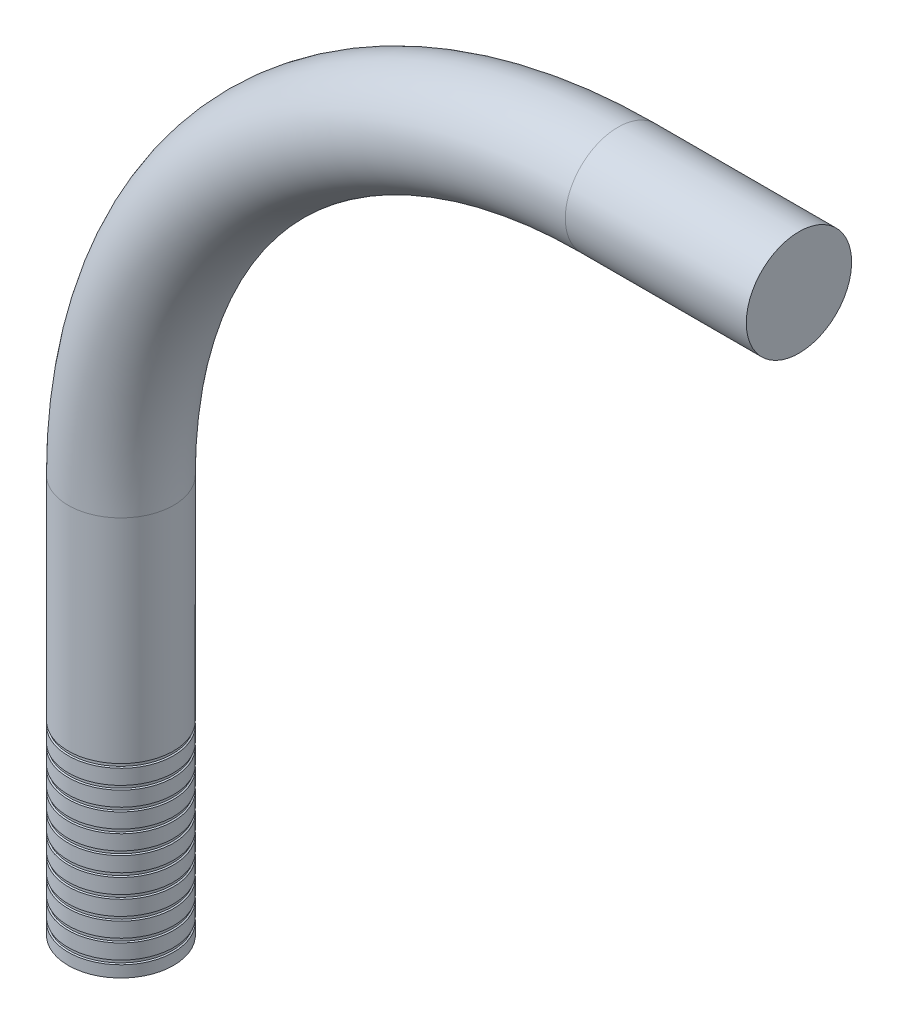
ISO-10303-21;
HEADER;
FILE_DESCRIPTION(('STEP AP214'),'2;1');
FILE_NAME('part.step','',(''),(''),'','','');
FILE_SCHEMA(('AUTOMOTIVE_DESIGN { 1 0 10303 214 1 1 1 1 }'));
ENDSEC;
DATA;
#1=APPLICATION_CONTEXT('core data for automotive mechanical design processes');
#2=APPLICATION_PROTOCOL_DEFINITION('international standard','automotive_design',2000,#1);
#3=PRODUCT_CONTEXT('',#1,'mechanical');
#4=PRODUCT('Part','Part','',(#3));
#5=PRODUCT_RELATED_PRODUCT_CATEGORY('part','',(#4));
#6=PRODUCT_DEFINITION_FORMATION('','',#4);
#7=PRODUCT_DEFINITION_CONTEXT('part definition',#1,'design');
#8=PRODUCT_DEFINITION('design','',#6,#7);
#9=PRODUCT_DEFINITION_SHAPE('','',#8);
#10=(LENGTH_UNIT() NAMED_UNIT(*) SI_UNIT(.MILLI.,.METRE.));
#11=(NAMED_UNIT(*) PLANE_ANGLE_UNIT() SI_UNIT($,.RADIAN.));
#12=(NAMED_UNIT(*) SI_UNIT($,.STERADIAN.) SOLID_ANGLE_UNIT());
#13=UNCERTAINTY_MEASURE_WITH_UNIT(LENGTH_MEASURE(1.E-05),#10,'distance_accuracy_value','');
#14=(GEOMETRIC_REPRESENTATION_CONTEXT(3) GLOBAL_UNCERTAINTY_ASSIGNED_CONTEXT((#13)) GLOBAL_UNIT_ASSIGNED_CONTEXT((#10,
#11,#12)) REPRESENTATION_CONTEXT('',''));
#15=CARTESIAN_POINT('',(0.,0.,0.));
#16=DIRECTION('',(0.,0.,1.));
#17=DIRECTION('',(1.,0.,0.));
#18=AXIS2_PLACEMENT_3D('',#15,#16,#17);
#19=CARTESIAN_POINT('',(0.,147.5,0.));
#20=DIRECTION('',(0.,-1.,0.));
#21=DIRECTION('',(0.,0.,-1.));
#22=AXIS2_PLACEMENT_3D('',#19,#20,#21);
#23=CYLINDRICAL_SURFACE('',#22,19.5);
#24=CARTESIAN_POINT('',(0.,67.25,0.));
#25=DIRECTION('',(0.,-1.,0.));
#26=DIRECTION('',(0.,0.,-1.));
#27=AXIS2_PLACEMENT_3D('',#24,#25,#26);
#28=CIRCLE('',#27,19.5);
#29=CARTESIAN_POINT('',(0.,67.25,-19.5));
#30=VERTEX_POINT('',#29);
#31=EDGE_CURVE('E145',#30,#30,#28,.T.);
#32=ORIENTED_EDGE('',*,*,#31,.T.);
#33=EDGE_LOOP('',(#32));
#34=FACE_BOUND('',#33,.T.);
#35=CARTESIAN_POINT('',(0.,61.75,0.));
#36=DIRECTION('',(0.,-1.,0.));
#37=DIRECTION('',(0.,0.,-1.));
#38=AXIS2_PLACEMENT_3D('',#35,#36,#37);
#39=CIRCLE('',#38,19.5);
#40=CARTESIAN_POINT('',(0.,61.75,-19.5));
#41=VERTEX_POINT('',#40);
#42=EDGE_CURVE('E136',#41,#41,#39,.T.);
#43=ORIENTED_EDGE('',*,*,#42,.F.);
#44=EDGE_LOOP('',(#43));
#45=FACE_BOUND('',#44,.T.);
#46=ADVANCED_FACE('F14',(#34,#45),#23,.T.);
#47=CARTESIAN_POINT('',(0.,60.25,0.));
#48=DIRECTION('',(0.,-1.,0.));
#49=DIRECTION('',(0.,0.,-1.));
#50=AXIS2_PLACEMENT_3D('',#47,#48,#49);
#51=CIRCLE('',#50,19.5);
#52=CARTESIAN_POINT('',(0.,60.25,-19.5));
#53=VERTEX_POINT('',#52);
#54=EDGE_CURVE('E133',#53,#53,#51,.T.);
#55=ORIENTED_EDGE('',*,*,#54,.T.);
#56=EDGE_LOOP('',(#55));
#57=FACE_BOUND('',#56,.T.);
#58=CARTESIAN_POINT('',(0.,54.75,0.));
#59=DIRECTION('',(0.,-1.,0.));
#60=DIRECTION('',(0.,0.,-1.));
#61=AXIS2_PLACEMENT_3D('',#58,#59,#60);
#62=CIRCLE('',#61,19.5);
#63=CARTESIAN_POINT('',(0.,54.75,-19.5));
#64=VERTEX_POINT('',#63);
#65=EDGE_CURVE('E124',#64,#64,#62,.T.);
#66=ORIENTED_EDGE('',*,*,#65,.F.);
#67=EDGE_LOOP('',(#66));
#68=FACE_BOUND('',#67,.T.);
#69=ADVANCED_FACE('F181',(#57,#68),#23,.T.);
#70=CARTESIAN_POINT('',(0.,53.25,0.));
#71=DIRECTION('',(0.,-1.,0.));
#72=DIRECTION('',(0.,0.,-1.));
#73=AXIS2_PLACEMENT_3D('',#70,#71,#72);
#74=CIRCLE('',#73,19.5);
#75=CARTESIAN_POINT('',(0.,53.25,-19.5));
#76=VERTEX_POINT('',#75);
#77=EDGE_CURVE('E121',#76,#76,#74,.T.);
#78=ORIENTED_EDGE('',*,*,#77,.T.);
#79=EDGE_LOOP('',(#78));
#80=FACE_BOUND('',#79,.T.);
#81=CARTESIAN_POINT('',(0.,47.75,0.));
#82=DIRECTION('',(0.,-1.,0.));
#83=DIRECTION('',(0.,0.,-1.));
#84=AXIS2_PLACEMENT_3D('',#81,#82,#83);
#85=CIRCLE('',#84,19.5);
#86=CARTESIAN_POINT('',(0.,47.75,-19.5));
#87=VERTEX_POINT('',#86);
#88=EDGE_CURVE('E112',#87,#87,#85,.T.);
#89=ORIENTED_EDGE('',*,*,#88,.F.);
#90=EDGE_LOOP('',(#89));
#91=FACE_BOUND('',#90,.T.);
#92=ADVANCED_FACE('F187',(#80,#91),#23,.T.);
#93=CARTESIAN_POINT('',(0.,46.25,0.));
#94=DIRECTION('',(0.,-1.,0.));
#95=DIRECTION('',(0.,0.,-1.));
#96=AXIS2_PLACEMENT_3D('',#93,#94,#95);
#97=CIRCLE('',#96,19.5);
#98=CARTESIAN_POINT('',(0.,46.25,-19.5));
#99=VERTEX_POINT('',#98);
#100=EDGE_CURVE('E109',#99,#99,#97,.T.);
#101=ORIENTED_EDGE('',*,*,#100,.T.);
#102=EDGE_LOOP('',(#101));
#103=FACE_BOUND('',#102,.T.);
#104=CARTESIAN_POINT('',(0.,40.75,0.));
#105=DIRECTION('',(0.,-1.,0.));
#106=DIRECTION('',(0.,0.,-1.));
#107=AXIS2_PLACEMENT_3D('',#104,#105,#106);
#108=CIRCLE('',#107,19.5);
#109=CARTESIAN_POINT('',(0.,40.75,-19.5));
#110=VERTEX_POINT('',#109);
#111=EDGE_CURVE('E100',#110,#110,#108,.T.);
#112=ORIENTED_EDGE('',*,*,#111,.F.);
#113=EDGE_LOOP('',(#112));
#114=FACE_BOUND('',#113,.T.);
#115=ADVANCED_FACE('F578',(#103,#114),#23,.T.);
#116=CARTESIAN_POINT('',(0.,39.25,0.));
#117=DIRECTION('',(0.,-1.,0.));
#118=DIRECTION('',(0.,0.,-1.));
#119=AXIS2_PLACEMENT_3D('',#116,#117,#118);
#120=CIRCLE('',#119,19.5);
#121=CARTESIAN_POINT('',(0.,39.25,-19.5));
#122=VERTEX_POINT('',#121);
#123=EDGE_CURVE('E97',#122,#122,#120,.T.);
#124=ORIENTED_EDGE('',*,*,#123,.T.);
#125=EDGE_LOOP('',(#124));
#126=FACE_BOUND('',#125,.T.);
#127=CARTESIAN_POINT('',(0.,33.75,0.));
#128=DIRECTION('',(0.,-1.,0.));
#129=DIRECTION('',(0.,0.,-1.));
#130=AXIS2_PLACEMENT_3D('',#127,#128,#129);
#131=CIRCLE('',#130,19.5);
#132=CARTESIAN_POINT('',(0.,33.75,-19.5));
#133=VERTEX_POINT('',#132);
#134=EDGE_CURVE('E88',#133,#133,#131,.T.);
#135=ORIENTED_EDGE('',*,*,#134,.F.);
#136=EDGE_LOOP('',(#135));
#137=FACE_BOUND('',#136,.T.);
#138=ADVANCED_FACE('F570',(#126,#137),#23,.T.);
#139=CARTESIAN_POINT('',(0.,32.25,0.));
#140=DIRECTION('',(0.,-1.,0.));
#141=DIRECTION('',(0.,0.,-1.));
#142=AXIS2_PLACEMENT_3D('',#139,#140,#141);
#143=CIRCLE('',#142,19.5);
#144=CARTESIAN_POINT('',(0.,32.25,-19.5));
#145=VERTEX_POINT('',#144);
#146=EDGE_CURVE('E85',#145,#145,#143,.T.);
#147=ORIENTED_EDGE('',*,*,#146,.T.);
#148=EDGE_LOOP('',(#147));
#149=FACE_BOUND('',#148,.T.);
#150=CARTESIAN_POINT('',(0.,26.75,0.));
#151=DIRECTION('',(0.,-1.,0.));
#152=DIRECTION('',(0.,0.,-1.));
#153=AXIS2_PLACEMENT_3D('',#150,#151,#152);
#154=CIRCLE('',#153,19.5);
#155=CARTESIAN_POINT('',(0.,26.75,-19.5));
#156=VERTEX_POINT('',#155);
#157=EDGE_CURVE('E76',#156,#156,#154,.T.);
#158=ORIENTED_EDGE('',*,*,#157,.F.);
#159=EDGE_LOOP('',(#158));
#160=FACE_BOUND('',#159,.T.);
#161=ADVANCED_FACE('F562',(#149,#160),#23,.T.);
#162=CARTESIAN_POINT('',(0.,25.25,0.));
#163=DIRECTION('',(0.,-1.,0.));
#164=DIRECTION('',(0.,0.,-1.));
#165=AXIS2_PLACEMENT_3D('',#162,#163,#164);
#166=CIRCLE('',#165,19.5);
#167=CARTESIAN_POINT('',(0.,25.25,-19.5));
#168=VERTEX_POINT('',#167);
#169=EDGE_CURVE('E73',#168,#168,#166,.T.);
#170=ORIENTED_EDGE('',*,*,#169,.T.);
#171=EDGE_LOOP('',(#170));
#172=FACE_BOUND('',#171,.T.);
#173=CARTESIAN_POINT('',(0.,19.75,0.));
#174=DIRECTION('',(0.,-1.,0.));
#175=DIRECTION('',(0.,0.,-1.));
#176=AXIS2_PLACEMENT_3D('',#173,#174,#175);
#177=CIRCLE('',#176,19.5);
#178=CARTESIAN_POINT('',(0.,19.75,-19.5));
#179=VERTEX_POINT('',#178);
#180=EDGE_CURVE('E64',#179,#179,#177,.T.);
#181=ORIENTED_EDGE('',*,*,#180,.F.);
#182=EDGE_LOOP('',(#181));
#183=FACE_BOUND('',#182,.T.);
#184=ADVANCED_FACE('F554',(#172,#183),#23,.T.);
#185=CARTESIAN_POINT('',(0.,18.25,0.));
#186=DIRECTION('',(0.,-1.,0.));
#187=DIRECTION('',(0.,0.,-1.));
#188=AXIS2_PLACEMENT_3D('',#185,#186,#187);
#189=CIRCLE('',#188,19.5);
#190=CARTESIAN_POINT('',(0.,18.25,-19.5));
#191=VERTEX_POINT('',#190);
#192=EDGE_CURVE('E61',#191,#191,#189,.T.);
#193=ORIENTED_EDGE('',*,*,#192,.T.);
#194=EDGE_LOOP('',(#193));
#195=FACE_BOUND('',#194,.T.);
#196=CARTESIAN_POINT('',(0.,12.75,0.));
#197=DIRECTION('',(0.,-1.,0.));
#198=DIRECTION('',(0.,0.,-1.));
#199=AXIS2_PLACEMENT_3D('',#196,#197,#198);
#200=CIRCLE('',#199,19.5);
#201=CARTESIAN_POINT('',(0.,12.75,-19.5));
#202=VERTEX_POINT('',#201);
#203=EDGE_CURVE('E52',#202,#202,#200,.T.);
#204=ORIENTED_EDGE('',*,*,#203,.F.);
#205=EDGE_LOOP('',(#204));
#206=FACE_BOUND('',#205,.T.);
#207=ADVANCED_FACE('F547',(#195,#206),#23,.T.);
#208=CARTESIAN_POINT('',(0.,11.25,0.));
#209=DIRECTION('',(0.,-1.,0.));
#210=DIRECTION('',(0.,0.,-1.));
#211=AXIS2_PLACEMENT_3D('',#208,#209,#210);
#212=CIRCLE('',#211,19.5);
#213=CARTESIAN_POINT('',(0.,11.25,-19.5));
#214=VERTEX_POINT('',#213);
#215=EDGE_CURVE('E49',#214,#214,#212,.T.);
#216=ORIENTED_EDGE('',*,*,#215,.T.);
#217=EDGE_LOOP('',(#216));
#218=FACE_BOUND('',#217,.T.);
#219=CARTESIAN_POINT('',(0.,5.75,0.));
#220=DIRECTION('',(0.,-1.,0.));
#221=DIRECTION('',(0.,0.,-1.));
#222=AXIS2_PLACEMENT_3D('',#219,#220,#221);
#223=CIRCLE('',#222,19.5);
#224=CARTESIAN_POINT('',(0.,5.75,-19.5));
#225=VERTEX_POINT('',#224);
#226=EDGE_CURVE('E40',#225,#225,#223,.T.);
#227=ORIENTED_EDGE('',*,*,#226,.F.);
#228=EDGE_LOOP('',(#227));
#229=FACE_BOUND('',#228,.T.);
#230=ADVANCED_FACE('F202',(#218,#229),#23,.T.);
#231=CARTESIAN_POINT('',(0.,0.,0.));
#232=DIRECTION('',(0.,-1.,0.));
#233=DIRECTION('',(0.,0.,-1.));
#234=AXIS2_PLACEMENT_3D('',#231,#232,#233);
#235=CYLINDRICAL_SURFACE('',#234,19.);
#236=CARTESIAN_POINT('',(0.,4.5,0.));
#237=DIRECTION('',(0.,-1.,0.));
#238=DIRECTION('',(0.,0.,-1.));
#239=AXIS2_PLACEMENT_3D('',#236,#237,#238);
#240=CIRCLE('',#239,19.);
#241=CARTESIAN_POINT('',(0.,4.5,-19.));
#242=VERTEX_POINT('',#241);
#243=EDGE_CURVE('E33',#242,#242,#240,.T.);
#244=ORIENTED_EDGE('',*,*,#243,.F.);
#245=EDGE_LOOP('',(#244));
#246=FACE_BOUND('',#245,.T.);
#247=CARTESIAN_POINT('',(0.,5.5,0.));
#248=DIRECTION('',(0.,-1.,0.));
#249=DIRECTION('',(0.,0.,-1.));
#250=AXIS2_PLACEMENT_3D('',#247,#248,#249);
#251=CIRCLE('',#250,19.);
#252=CARTESIAN_POINT('',(0.,5.5,-19.));
#253=VERTEX_POINT('',#252);
#254=EDGE_CURVE('E43',#253,#253,#251,.T.);
#255=ORIENTED_EDGE('',*,*,#254,.T.);
#256=EDGE_LOOP('',(#255));
#257=FACE_BOUND('',#256,.T.);
#258=ADVANCED_FACE('F198',(#246,#257),#235,.T.);
#259=CARTESIAN_POINT('',(0.,4.5,0.));
#260=DIRECTION('',(0.,-1.,0.));
#261=DIRECTION('',(0.,0.,-1.));
#262=AXIS2_PLACEMENT_3D('',#259,#260,#261);
#263=CONICAL_SURFACE('',#262,19.,1.10714871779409);
#264=CARTESIAN_POINT('',(0.,4.25,0.));
#265=DIRECTION('',(0.,-1.,0.));
#266=DIRECTION('',(0.,0.,-1.));
#267=AXIS2_PLACEMENT_3D('',#264,#265,#266);
#268=CIRCLE('',#267,19.5);
#269=CARTESIAN_POINT('',(0.,4.25,-19.5));
#270=VERTEX_POINT('',#269);
#271=EDGE_CURVE('E37',#270,#270,#268,.T.);
#272=ORIENTED_EDGE('',*,*,#271,.F.);
#273=EDGE_LOOP('',(#272));
#274=FACE_BOUND('',#273,.T.);
#275=ORIENTED_EDGE('',*,*,#243,.T.);
#276=EDGE_LOOP('',(#275));
#277=FACE_BOUND('',#276,.T.);
#278=ADVANCED_FACE('F201',(#274,#277),#263,.T.);
#279=CARTESIAN_POINT('',(0.,5.75,0.));
#280=DIRECTION('',(0.,1.,0.));
#281=DIRECTION('',(0.,0.,1.));
#282=AXIS2_PLACEMENT_3D('',#279,#280,#281);
#283=CONICAL_SURFACE('',#282,19.5,1.10714871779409);
#284=ORIENTED_EDGE('',*,*,#254,.F.);
#285=EDGE_LOOP('',(#284));
#286=FACE_BOUND('',#285,.T.);
#287=ORIENTED_EDGE('',*,*,#226,.T.);
#288=EDGE_LOOP('',(#287));
#289=FACE_BOUND('',#288,.T.);
#290=ADVANCED_FACE('F194',(#286,#289),#283,.T.);
#291=CARTESIAN_POINT('',(0.,0.,0.));
#292=DIRECTION('',(0.,1.,0.));
#293=DIRECTION('',(0.,0.,1.));
#294=AXIS2_PLACEMENT_3D('',#291,#292,#293);
#295=PLANE('',#294);
#296=CARTESIAN_POINT('',(0.,0.,0.));
#297=DIRECTION('',(0.,1.,0.));
#298=DIRECTION('',(0.,0.,1.));
#299=AXIS2_PLACEMENT_3D('',#296,#297,#298);
#300=CIRCLE('',#299,19.5);
#301=CARTESIAN_POINT('',(0.,0.,19.5));
#302=VERTEX_POINT('',#301);
#303=EDGE_CURVE('E29',#302,#302,#300,.T.);
#304=ORIENTED_EDGE('',*,*,#303,.F.);
#305=EDGE_LOOP('',(#304));
#306=FACE_BOUND('',#305,.T.);
#307=ADVANCED_FACE('F191',(#306),#295,.F.);
#308=ORIENTED_EDGE('',*,*,#271,.T.);
#309=EDGE_LOOP('',(#308));
#310=FACE_BOUND('',#309,.T.);
#311=ORIENTED_EDGE('',*,*,#303,.T.);
#312=EDGE_LOOP('',(#311));
#313=FACE_BOUND('',#312,.T.);
#314=ADVANCED_FACE('F170',(#310,#313),#23,.T.);
#315=CARTESIAN_POINT('',(0.,7.,0.));
#316=DIRECTION('',(0.,-1.,0.));
#317=DIRECTION('',(0.,0.,-1.));
#318=AXIS2_PLACEMENT_3D('',#315,#316,#317);
#319=CYLINDRICAL_SURFACE('',#318,19.);
#320=CARTESIAN_POINT('',(0.,11.5,0.));
#321=DIRECTION('',(0.,-1.,0.));
#322=DIRECTION('',(0.,0.,-1.));
#323=AXIS2_PLACEMENT_3D('',#320,#321,#322);
#324=CIRCLE('',#323,19.);
#325=CARTESIAN_POINT('',(0.,11.5,-19.));
#326=VERTEX_POINT('',#325);
#327=EDGE_CURVE('E46',#326,#326,#324,.T.);
#328=ORIENTED_EDGE('',*,*,#327,.F.);
#329=EDGE_LOOP('',(#328));
#330=FACE_BOUND('',#329,.T.);
#331=CARTESIAN_POINT('',(0.,12.5,0.));
#332=DIRECTION('',(0.,-1.,0.));
#333=DIRECTION('',(0.,0.,-1.));
#334=AXIS2_PLACEMENT_3D('',#331,#332,#333);
#335=CIRCLE('',#334,19.);
#336=CARTESIAN_POINT('',(0.,12.5,-19.));
#337=VERTEX_POINT('',#336);
#338=EDGE_CURVE('E55',#337,#337,#335,.T.);
#339=ORIENTED_EDGE('',*,*,#338,.T.);
#340=EDGE_LOOP('',(#339));
#341=FACE_BOUND('',#340,.T.);
#342=ADVANCED_FACE('F210',(#330,#341),#319,.T.);
#343=CARTESIAN_POINT('',(0.,11.5,0.));
#344=DIRECTION('',(0.,-1.,0.));
#345=DIRECTION('',(0.,0.,-1.));
#346=AXIS2_PLACEMENT_3D('',#343,#344,#345);
#347=CONICAL_SURFACE('',#346,19.,1.10714871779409);
#348=ORIENTED_EDGE('',*,*,#215,.F.);
#349=EDGE_LOOP('',(#348));
#350=FACE_BOUND('',#349,.T.);
#351=ORIENTED_EDGE('',*,*,#327,.T.);
#352=EDGE_LOOP('',(#351));
#353=FACE_BOUND('',#352,.T.);
#354=ADVANCED_FACE('F213',(#350,#353),#347,.T.);
#355=CARTESIAN_POINT('',(0.,12.75,0.));
#356=DIRECTION('',(0.,1.,0.));
#357=DIRECTION('',(0.,0.,1.));
#358=AXIS2_PLACEMENT_3D('',#355,#356,#357);
#359=CONICAL_SURFACE('',#358,19.5,1.10714871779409);
#360=ORIENTED_EDGE('',*,*,#338,.F.);
#361=EDGE_LOOP('',(#360));
#362=FACE_BOUND('',#361,.T.);
#363=ORIENTED_EDGE('',*,*,#203,.T.);
#364=EDGE_LOOP('',(#363));
#365=FACE_BOUND('',#364,.T.);
#366=ADVANCED_FACE('F217',(#362,#365),#359,.T.);
#367=CARTESIAN_POINT('',(0.,14.,0.));
#368=DIRECTION('',(0.,-1.,0.));
#369=DIRECTION('',(0.,0.,-1.));
#370=AXIS2_PLACEMENT_3D('',#367,#368,#369);
#371=CYLINDRICAL_SURFACE('',#370,19.);
#372=CARTESIAN_POINT('',(0.,18.5,0.));
#373=DIRECTION('',(0.,-1.,0.));
#374=DIRECTION('',(0.,0.,-1.));
#375=AXIS2_PLACEMENT_3D('',#372,#373,#374);
#376=CIRCLE('',#375,19.);
#377=CARTESIAN_POINT('',(0.,18.5,-19.));
#378=VERTEX_POINT('',#377);
#379=EDGE_CURVE('E58',#378,#378,#376,.T.);
#380=ORIENTED_EDGE('',*,*,#379,.F.);
#381=EDGE_LOOP('',(#380));
#382=FACE_BOUND('',#381,.T.);
#383=CARTESIAN_POINT('',(0.,19.5,0.));
#384=DIRECTION('',(0.,-1.,0.));
#385=DIRECTION('',(0.,0.,-1.));
#386=AXIS2_PLACEMENT_3D('',#383,#384,#385);
#387=CIRCLE('',#386,19.);
#388=CARTESIAN_POINT('',(0.,19.5,-19.));
#389=VERTEX_POINT('',#388);
#390=EDGE_CURVE('E67',#389,#389,#387,.T.);
#391=ORIENTED_EDGE('',*,*,#390,.T.);
#392=EDGE_LOOP('',(#391));
#393=FACE_BOUND('',#392,.T.);
#394=ADVANCED_FACE('F221',(#382,#393),#371,.T.);
#395=CARTESIAN_POINT('',(0.,18.5,0.));
#396=DIRECTION('',(0.,-1.,0.));
#397=DIRECTION('',(0.,0.,-1.));
#398=AXIS2_PLACEMENT_3D('',#395,#396,#397);
#399=CONICAL_SURFACE('',#398,19.,1.10714871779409);
#400=ORIENTED_EDGE('',*,*,#192,.F.);
#401=EDGE_LOOP('',(#400));
#402=FACE_BOUND('',#401,.T.);
#403=ORIENTED_EDGE('',*,*,#379,.T.);
#404=EDGE_LOOP('',(#403));
#405=FACE_BOUND('',#404,.T.);
#406=ADVANCED_FACE('F225',(#402,#405),#399,.T.);
#407=CARTESIAN_POINT('',(0.,19.75,0.));
#408=DIRECTION('',(0.,1.,0.));
#409=DIRECTION('',(0.,0.,1.));
#410=AXIS2_PLACEMENT_3D('',#407,#408,#409);
#411=CONICAL_SURFACE('',#410,19.5,1.10714871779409);
#412=ORIENTED_EDGE('',*,*,#390,.F.);
#413=EDGE_LOOP('',(#412));
#414=FACE_BOUND('',#413,.T.);
#415=ORIENTED_EDGE('',*,*,#180,.T.);
#416=EDGE_LOOP('',(#415));
#417=FACE_BOUND('',#416,.T.);
#418=ADVANCED_FACE('F229',(#414,#417),#411,.T.);
#419=CARTESIAN_POINT('',(0.,21.,0.));
#420=DIRECTION('',(0.,-1.,0.));
#421=DIRECTION('',(0.,0.,-1.));
#422=AXIS2_PLACEMENT_3D('',#419,#420,#421);
#423=CYLINDRICAL_SURFACE('',#422,19.);
#424=CARTESIAN_POINT('',(0.,25.5,0.));
#425=DIRECTION('',(0.,-1.,0.));
#426=DIRECTION('',(0.,0.,-1.));
#427=AXIS2_PLACEMENT_3D('',#424,#425,#426);
#428=CIRCLE('',#427,19.);
#429=CARTESIAN_POINT('',(0.,25.5,-19.));
#430=VERTEX_POINT('',#429);
#431=EDGE_CURVE('E70',#430,#430,#428,.T.);
#432=ORIENTED_EDGE('',*,*,#431,.F.);
#433=EDGE_LOOP('',(#432));
#434=FACE_BOUND('',#433,.T.);
#435=CARTESIAN_POINT('',(0.,26.5,0.));
#436=DIRECTION('',(0.,-1.,0.));
#437=DIRECTION('',(0.,0.,-1.));
#438=AXIS2_PLACEMENT_3D('',#435,#436,#437);
#439=CIRCLE('',#438,19.);
#440=CARTESIAN_POINT('',(0.,26.5,-19.));
#441=VERTEX_POINT('',#440);
#442=EDGE_CURVE('E79',#441,#441,#439,.T.);
#443=ORIENTED_EDGE('',*,*,#442,.T.);
#444=EDGE_LOOP('',(#443));
#445=FACE_BOUND('',#444,.T.);
#446=ADVANCED_FACE('F233',(#434,#445),#423,.T.);
#447=CARTESIAN_POINT('',(0.,25.5,0.));
#448=DIRECTION('',(0.,-1.,0.));
#449=DIRECTION('',(0.,0.,-1.));
#450=AXIS2_PLACEMENT_3D('',#447,#448,#449);
#451=CONICAL_SURFACE('',#450,19.,1.10714871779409);
#452=ORIENTED_EDGE('',*,*,#169,.F.);
#453=EDGE_LOOP('',(#452));
#454=FACE_BOUND('',#453,.T.);
#455=ORIENTED_EDGE('',*,*,#431,.T.);
#456=EDGE_LOOP('',(#455));
#457=FACE_BOUND('',#456,.T.);
#458=ADVANCED_FACE('F237',(#454,#457),#451,.T.);
#459=CARTESIAN_POINT('',(0.,26.75,0.));
#460=DIRECTION('',(0.,1.,0.));
#461=DIRECTION('',(0.,0.,1.));
#462=AXIS2_PLACEMENT_3D('',#459,#460,#461);
#463=CONICAL_SURFACE('',#462,19.5,1.10714871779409);
#464=ORIENTED_EDGE('',*,*,#442,.F.);
#465=EDGE_LOOP('',(#464));
#466=FACE_BOUND('',#465,.T.);
#467=ORIENTED_EDGE('',*,*,#157,.T.);
#468=EDGE_LOOP('',(#467));
#469=FACE_BOUND('',#468,.T.);
#470=ADVANCED_FACE('F241',(#466,#469),#463,.T.);
#471=CARTESIAN_POINT('',(0.,28.,0.));
#472=DIRECTION('',(0.,-1.,0.));
#473=DIRECTION('',(0.,0.,-1.));
#474=AXIS2_PLACEMENT_3D('',#471,#472,#473);
#475=CYLINDRICAL_SURFACE('',#474,19.);
#476=CARTESIAN_POINT('',(0.,32.5,0.));
#477=DIRECTION('',(0.,-1.,0.));
#478=DIRECTION('',(0.,0.,-1.));
#479=AXIS2_PLACEMENT_3D('',#476,#477,#478);
#480=CIRCLE('',#479,19.);
#481=CARTESIAN_POINT('',(0.,32.5,-19.));
#482=VERTEX_POINT('',#481);
#483=EDGE_CURVE('E82',#482,#482,#480,.T.);
#484=ORIENTED_EDGE('',*,*,#483,.F.);
#485=EDGE_LOOP('',(#484));
#486=FACE_BOUND('',#485,.T.);
#487=CARTESIAN_POINT('',(0.,33.5,0.));
#488=DIRECTION('',(0.,-1.,0.));
#489=DIRECTION('',(0.,0.,-1.));
#490=AXIS2_PLACEMENT_3D('',#487,#488,#489);
#491=CIRCLE('',#490,19.);
#492=CARTESIAN_POINT('',(0.,33.5,-19.));
#493=VERTEX_POINT('',#492);
#494=EDGE_CURVE('E91',#493,#493,#491,.T.);
#495=ORIENTED_EDGE('',*,*,#494,.T.);
#496=EDGE_LOOP('',(#495));
#497=FACE_BOUND('',#496,.T.);
#498=ADVANCED_FACE('F245',(#486,#497),#475,.T.);
#499=CARTESIAN_POINT('',(0.,32.5,0.));
#500=DIRECTION('',(0.,-1.,0.));
#501=DIRECTION('',(0.,0.,-1.));
#502=AXIS2_PLACEMENT_3D('',#499,#500,#501);
#503=CONICAL_SURFACE('',#502,19.,1.10714871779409);
#504=ORIENTED_EDGE('',*,*,#146,.F.);
#505=EDGE_LOOP('',(#504));
#506=FACE_BOUND('',#505,.T.);
#507=ORIENTED_EDGE('',*,*,#483,.T.);
#508=EDGE_LOOP('',(#507));
#509=FACE_BOUND('',#508,.T.);
#510=ADVANCED_FACE('F249',(#506,#509),#503,.T.);
#511=CARTESIAN_POINT('',(0.,33.75,0.));
#512=DIRECTION('',(0.,1.,0.));
#513=DIRECTION('',(0.,0.,1.));
#514=AXIS2_PLACEMENT_3D('',#511,#512,#513);
#515=CONICAL_SURFACE('',#514,19.5,1.10714871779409);
#516=ORIENTED_EDGE('',*,*,#494,.F.);
#517=EDGE_LOOP('',(#516));
#518=FACE_BOUND('',#517,.T.);
#519=ORIENTED_EDGE('',*,*,#134,.T.);
#520=EDGE_LOOP('',(#519));
#521=FACE_BOUND('',#520,.T.);
#522=ADVANCED_FACE('F253',(#518,#521),#515,.T.);
#523=CARTESIAN_POINT('',(0.,35.,0.));
#524=DIRECTION('',(0.,-1.,0.));
#525=DIRECTION('',(0.,0.,-1.));
#526=AXIS2_PLACEMENT_3D('',#523,#524,#525);
#527=CYLINDRICAL_SURFACE('',#526,19.);
#528=CARTESIAN_POINT('',(0.,39.5,0.));
#529=DIRECTION('',(0.,-1.,0.));
#530=DIRECTION('',(0.,0.,-1.));
#531=AXIS2_PLACEMENT_3D('',#528,#529,#530);
#532=CIRCLE('',#531,19.);
#533=CARTESIAN_POINT('',(0.,39.5,-19.));
#534=VERTEX_POINT('',#533);
#535=EDGE_CURVE('E94',#534,#534,#532,.T.);
#536=ORIENTED_EDGE('',*,*,#535,.F.);
#537=EDGE_LOOP('',(#536));
#538=FACE_BOUND('',#537,.T.);
#539=CARTESIAN_POINT('',(0.,40.5,0.));
#540=DIRECTION('',(0.,-1.,0.));
#541=DIRECTION('',(0.,0.,-1.));
#542=AXIS2_PLACEMENT_3D('',#539,#540,#541);
#543=CIRCLE('',#542,19.);
#544=CARTESIAN_POINT('',(0.,40.5,-19.));
#545=VERTEX_POINT('',#544);
#546=EDGE_CURVE('E103',#545,#545,#543,.T.);
#547=ORIENTED_EDGE('',*,*,#546,.T.);
#548=EDGE_LOOP('',(#547));
#549=FACE_BOUND('',#548,.T.);
#550=ADVANCED_FACE('F257',(#538,#549),#527,.T.);
#551=CARTESIAN_POINT('',(0.,39.5,0.));
#552=DIRECTION('',(0.,-1.,0.));
#553=DIRECTION('',(0.,0.,-1.));
#554=AXIS2_PLACEMENT_3D('',#551,#552,#553);
#555=CONICAL_SURFACE('',#554,19.,1.10714871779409);
#556=ORIENTED_EDGE('',*,*,#123,.F.);
#557=EDGE_LOOP('',(#556));
#558=FACE_BOUND('',#557,.T.);
#559=ORIENTED_EDGE('',*,*,#535,.T.);
#560=EDGE_LOOP('',(#559));
#561=FACE_BOUND('',#560,.T.);
#562=ADVANCED_FACE('F261',(#558,#561),#555,.T.);
#563=CARTESIAN_POINT('',(0.,40.75,0.));
#564=DIRECTION('',(0.,1.,0.));
#565=DIRECTION('',(0.,0.,1.));
#566=AXIS2_PLACEMENT_3D('',#563,#564,#565);
#567=CONICAL_SURFACE('',#566,19.5,1.10714871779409);
#568=ORIENTED_EDGE('',*,*,#546,.F.);
#569=EDGE_LOOP('',(#568));
#570=FACE_BOUND('',#569,.T.);
#571=ORIENTED_EDGE('',*,*,#111,.T.);
#572=EDGE_LOOP('',(#571));
#573=FACE_BOUND('',#572,.T.);
#574=ADVANCED_FACE('F265',(#570,#573),#567,.T.);
#575=CARTESIAN_POINT('',(0.,42.,0.));
#576=DIRECTION('',(0.,-1.,0.));
#577=DIRECTION('',(0.,0.,-1.));
#578=AXIS2_PLACEMENT_3D('',#575,#576,#577);
#579=CYLINDRICAL_SURFACE('',#578,19.);
#580=CARTESIAN_POINT('',(0.,46.5,0.));
#581=DIRECTION('',(0.,-1.,0.));
#582=DIRECTION('',(0.,0.,-1.));
#583=AXIS2_PLACEMENT_3D('',#580,#581,#582);
#584=CIRCLE('',#583,19.);
#585=CARTESIAN_POINT('',(0.,46.5,-19.));
#586=VERTEX_POINT('',#585);
#587=EDGE_CURVE('E106',#586,#586,#584,.T.);
#588=ORIENTED_EDGE('',*,*,#587,.F.);
#589=EDGE_LOOP('',(#588));
#590=FACE_BOUND('',#589,.T.);
#591=CARTESIAN_POINT('',(0.,47.5,0.));
#592=DIRECTION('',(0.,-1.,0.));
#593=DIRECTION('',(0.,0.,-1.));
#594=AXIS2_PLACEMENT_3D('',#591,#592,#593);
#595=CIRCLE('',#594,19.);
#596=CARTESIAN_POINT('',(0.,47.5,-19.));
#597=VERTEX_POINT('',#596);
#598=EDGE_CURVE('E115',#597,#597,#595,.T.);
#599=ORIENTED_EDGE('',*,*,#598,.T.);
#600=EDGE_LOOP('',(#599));
#601=FACE_BOUND('',#600,.T.);
#602=ADVANCED_FACE('F269',(#590,#601),#579,.T.);
#603=CARTESIAN_POINT('',(0.,46.5,0.));
#604=DIRECTION('',(0.,-1.,0.));
#605=DIRECTION('',(0.,0.,-1.));
#606=AXIS2_PLACEMENT_3D('',#603,#604,#605);
#607=CONICAL_SURFACE('',#606,19.,1.10714871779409);
#608=ORIENTED_EDGE('',*,*,#100,.F.);
#609=EDGE_LOOP('',(#608));
#610=FACE_BOUND('',#609,.T.);
#611=ORIENTED_EDGE('',*,*,#587,.T.);
#612=EDGE_LOOP('',(#611));
#613=FACE_BOUND('',#612,.T.);
#614=ADVANCED_FACE('F273',(#610,#613),#607,.T.);
#615=CARTESIAN_POINT('',(0.,47.75,0.));
#616=DIRECTION('',(0.,1.,0.));
#617=DIRECTION('',(0.,0.,1.));
#618=AXIS2_PLACEMENT_3D('',#615,#616,#617);
#619=CONICAL_SURFACE('',#618,19.5,1.10714871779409);
#620=ORIENTED_EDGE('',*,*,#598,.F.);
#621=EDGE_LOOP('',(#620));
#622=FACE_BOUND('',#621,.T.);
#623=ORIENTED_EDGE('',*,*,#88,.T.);
#624=EDGE_LOOP('',(#623));
#625=FACE_BOUND('',#624,.T.);
#626=ADVANCED_FACE('F277',(#622,#625),#619,.T.);
#627=CARTESIAN_POINT('',(0.,49.,0.));
#628=DIRECTION('',(0.,-1.,0.));
#629=DIRECTION('',(0.,0.,-1.));
#630=AXIS2_PLACEMENT_3D('',#627,#628,#629);
#631=CYLINDRICAL_SURFACE('',#630,19.);
#632=CARTESIAN_POINT('',(0.,53.5,0.));
#633=DIRECTION('',(0.,-1.,0.));
#634=DIRECTION('',(0.,0.,-1.));
#635=AXIS2_PLACEMENT_3D('',#632,#633,#634);
#636=CIRCLE('',#635,19.);
#637=CARTESIAN_POINT('',(0.,53.5,-19.));
#638=VERTEX_POINT('',#637);
#639=EDGE_CURVE('E118',#638,#638,#636,.T.);
#640=ORIENTED_EDGE('',*,*,#639,.F.);
#641=EDGE_LOOP('',(#640));
#642=FACE_BOUND('',#641,.T.);
#643=CARTESIAN_POINT('',(0.,54.5,0.));
#644=DIRECTION('',(0.,-1.,0.));
#645=DIRECTION('',(0.,0.,-1.));
#646=AXIS2_PLACEMENT_3D('',#643,#644,#645);
#647=CIRCLE('',#646,19.);
#648=CARTESIAN_POINT('',(0.,54.5,-19.));
#649=VERTEX_POINT('',#648);
#650=EDGE_CURVE('E127',#649,#649,#647,.T.);
#651=ORIENTED_EDGE('',*,*,#650,.T.);
#652=EDGE_LOOP('',(#651));
#653=FACE_BOUND('',#652,.T.);
#654=ADVANCED_FACE('F281',(#642,#653),#631,.T.);
#655=CARTESIAN_POINT('',(0.,53.5,0.));
#656=DIRECTION('',(0.,-1.,0.));
#657=DIRECTION('',(0.,0.,-1.));
#658=AXIS2_PLACEMENT_3D('',#655,#656,#657);
#659=CONICAL_SURFACE('',#658,19.,1.10714871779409);
#660=ORIENTED_EDGE('',*,*,#77,.F.);
#661=EDGE_LOOP('',(#660));
#662=FACE_BOUND('',#661,.T.);
#663=ORIENTED_EDGE('',*,*,#639,.T.);
#664=EDGE_LOOP('',(#663));
#665=FACE_BOUND('',#664,.T.);
#666=ADVANCED_FACE('F285',(#662,#665),#659,.T.);
#667=CARTESIAN_POINT('',(0.,54.75,0.));
#668=DIRECTION('',(0.,1.,0.));
#669=DIRECTION('',(0.,0.,1.));
#670=AXIS2_PLACEMENT_3D('',#667,#668,#669);
#671=CONICAL_SURFACE('',#670,19.5,1.10714871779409);
#672=ORIENTED_EDGE('',*,*,#650,.F.);
#673=EDGE_LOOP('',(#672));
#674=FACE_BOUND('',#673,.T.);
#675=ORIENTED_EDGE('',*,*,#65,.T.);
#676=EDGE_LOOP('',(#675));
#677=FACE_BOUND('',#676,.T.);
#678=ADVANCED_FACE('F289',(#674,#677),#671,.T.);
#679=CARTESIAN_POINT('',(0.,56.,0.));
#680=DIRECTION('',(0.,-1.,0.));
#681=DIRECTION('',(0.,0.,-1.));
#682=AXIS2_PLACEMENT_3D('',#679,#680,#681);
#683=CYLINDRICAL_SURFACE('',#682,19.);
#684=CARTESIAN_POINT('',(0.,60.5,0.));
#685=DIRECTION('',(0.,-1.,0.));
#686=DIRECTION('',(0.,0.,-1.));
#687=AXIS2_PLACEMENT_3D('',#684,#685,#686);
#688=CIRCLE('',#687,19.);
#689=CARTESIAN_POINT('',(0.,60.5,-19.));
#690=VERTEX_POINT('',#689);
#691=EDGE_CURVE('E130',#690,#690,#688,.T.);
#692=ORIENTED_EDGE('',*,*,#691,.F.);
#693=EDGE_LOOP('',(#692));
#694=FACE_BOUND('',#693,.T.);
#695=CARTESIAN_POINT('',(0.,61.5,0.));
#696=DIRECTION('',(0.,-1.,0.));
#697=DIRECTION('',(0.,0.,-1.));
#698=AXIS2_PLACEMENT_3D('',#695,#696,#697);
#699=CIRCLE('',#698,19.);
#700=CARTESIAN_POINT('',(0.,61.5,-19.));
#701=VERTEX_POINT('',#700);
#702=EDGE_CURVE('E139',#701,#701,#699,.T.);
#703=ORIENTED_EDGE('',*,*,#702,.T.);
#704=EDGE_LOOP('',(#703));
#705=FACE_BOUND('',#704,.T.);
#706=ADVANCED_FACE('F293',(#694,#705),#683,.T.);
#707=CARTESIAN_POINT('',(0.,60.5,0.));
#708=DIRECTION('',(0.,-1.,0.));
#709=DIRECTION('',(0.,0.,-1.));
#710=AXIS2_PLACEMENT_3D('',#707,#708,#709);
#711=CONICAL_SURFACE('',#710,19.,1.10714871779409);
#712=ORIENTED_EDGE('',*,*,#54,.F.);
#713=EDGE_LOOP('',(#712));
#714=FACE_BOUND('',#713,.T.);
#715=ORIENTED_EDGE('',*,*,#691,.T.);
#716=EDGE_LOOP('',(#715));
#717=FACE_BOUND('',#716,.T.);
#718=ADVANCED_FACE('F297',(#714,#717),#711,.T.);
#719=CARTESIAN_POINT('',(0.,61.75,0.));
#720=DIRECTION('',(0.,1.,0.));
#721=DIRECTION('',(0.,0.,1.));
#722=AXIS2_PLACEMENT_3D('',#719,#720,#721);
#723=CONICAL_SURFACE('',#722,19.5,1.10714871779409);
#724=ORIENTED_EDGE('',*,*,#702,.F.);
#725=EDGE_LOOP('',(#724));
#726=FACE_BOUND('',#725,.T.);
#727=ORIENTED_EDGE('',*,*,#42,.T.);
#728=EDGE_LOOP('',(#727));
#729=FACE_BOUND('',#728,.T.);
#730=ADVANCED_FACE('F301',(#726,#729),#723,.T.);
#731=CARTESIAN_POINT('',(0.,63.,0.));
#732=DIRECTION('',(0.,-1.,0.));
#733=DIRECTION('',(0.,0.,-1.));
#734=AXIS2_PLACEMENT_3D('',#731,#732,#733);
#735=CYLINDRICAL_SURFACE('',#734,19.);
#736=CARTESIAN_POINT('',(0.,67.5,0.));
#737=DIRECTION('',(0.,-1.,0.));
#738=DIRECTION('',(0.,0.,-1.));
#739=AXIS2_PLACEMENT_3D('',#736,#737,#738);
#740=CIRCLE('',#739,19.);
#741=CARTESIAN_POINT('',(0.,67.5,-19.));
#742=VERTEX_POINT('',#741);
#743=EDGE_CURVE('E142',#742,#742,#740,.T.);
#744=ORIENTED_EDGE('',*,*,#743,.F.);
#745=EDGE_LOOP('',(#744));
#746=FACE_BOUND('',#745,.T.);
#747=CARTESIAN_POINT('',(0.,68.5,0.));
#748=DIRECTION('',(0.,-1.,0.));
#749=DIRECTION('',(0.,0.,-1.));
#750=AXIS2_PLACEMENT_3D('',#747,#748,#749);
#751=CIRCLE('',#750,19.);
#752=CARTESIAN_POINT('',(0.,68.5,-19.));
#753=VERTEX_POINT('',#752);
#754=EDGE_CURVE('E151',#753,#753,#751,.T.);
#755=ORIENTED_EDGE('',*,*,#754,.T.);
#756=EDGE_LOOP('',(#755));
#757=FACE_BOUND('',#756,.T.);
#758=ADVANCED_FACE('F155',(#746,#757),#735,.T.);
#759=CARTESIAN_POINT('',(0.,67.5,0.));
#760=DIRECTION('',(0.,-1.,0.));
#761=DIRECTION('',(0.,0.,-1.));
#762=AXIS2_PLACEMENT_3D('',#759,#760,#761);
#763=CONICAL_SURFACE('',#762,19.,1.10714871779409);
#764=ORIENTED_EDGE('',*,*,#31,.F.);
#765=EDGE_LOOP('',(#764));
#766=FACE_BOUND('',#765,.T.);
#767=ORIENTED_EDGE('',*,*,#743,.T.);
#768=EDGE_LOOP('',(#767));
#769=FACE_BOUND('',#768,.T.);
#770=ADVANCED_FACE('F161',(#766,#769),#763,.T.);
#771=CARTESIAN_POINT('',(0.,68.75,0.));
#772=DIRECTION('',(0.,1.,0.));
#773=DIRECTION('',(0.,0.,1.));
#774=AXIS2_PLACEMENT_3D('',#771,#772,#773);
#775=CONICAL_SURFACE('',#774,19.5,1.10714871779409);
#776=ORIENTED_EDGE('',*,*,#754,.F.);
#777=EDGE_LOOP('',(#776));
#778=FACE_BOUND('',#777,.T.);
#779=CARTESIAN_POINT('',(0.,68.75,0.));
#780=DIRECTION('',(0.,-1.,0.));
#781=DIRECTION('',(0.,0.,-1.));
#782=AXIS2_PLACEMENT_3D('',#779,#780,#781);
#783=CIRCLE('',#782,19.5);
#784=CARTESIAN_POINT('',(0.,68.75,-19.5));
#785=VERTEX_POINT('',#784);
#786=EDGE_CURVE('E148',#785,#785,#783,.T.);
#787=ORIENTED_EDGE('',*,*,#786,.T.);
#788=EDGE_LOOP('',(#787));
#789=FACE_BOUND('',#788,.T.);
#790=ADVANCED_FACE('F157',(#778,#789),#775,.T.);
#791=CARTESIAN_POINT('',(251.,331.5,0.));
#792=DIRECTION('',(1.,0.,0.));
#793=DIRECTION('',(0.,0.,1.));
#794=AXIS2_PLACEMENT_3D('',#791,#792,#793);
#795=PLANE('',#794);
#796=CARTESIAN_POINT('',(251.,331.5,0.));
#797=DIRECTION('',(1.,0.,0.));
#798=DIRECTION('',(0.,0.,1.));
#799=AXIS2_PLACEMENT_3D('',#796,#797,#798);
#800=CIRCLE('',#799,19.5);
#801=CARTESIAN_POINT('',(251.,331.5,19.5));
#802=VERTEX_POINT('',#801);
#803=EDGE_CURVE('E9',#802,#802,#800,.T.);
#804=ORIENTED_EDGE('',*,*,#803,.T.);
#805=EDGE_LOOP('',(#804));
#806=FACE_BOUND('',#805,.T.);
#807=ADVANCED_FACE('F160',(#806),#795,.T.);
#808=CARTESIAN_POINT('',(184.,331.5,0.));
#809=DIRECTION('',(1.,0.,0.));
#810=DIRECTION('',(0.,0.,-1.));
#811=AXIS2_PLACEMENT_3D('',#808,#809,#810);
#812=CYLINDRICAL_SURFACE('',#811,19.5);
#813=CARTESIAN_POINT('',(184.,331.5,0.));
#814=DIRECTION('',(1.,0.,0.));
#815=DIRECTION('',(0.,0.,1.));
#816=AXIS2_PLACEMENT_3D('',#813,#814,#815);
#817=CIRCLE('',#816,19.5);
#818=CARTESIAN_POINT('',(184.,351.,0.));
#819=VERTEX_POINT('',#818);
#820=EDGE_CURVE('E21',#819,#819,#817,.T.);
#821=ORIENTED_EDGE('',*,*,#820,.T.);
#822=EDGE_LOOP('',(#821));
#823=FACE_BOUND('',#822,.T.);
#824=ORIENTED_EDGE('',*,*,#803,.F.);
#825=EDGE_LOOP('',(#824));
#826=FACE_BOUND('',#825,.T.);
#827=ADVANCED_FACE('F16',(#823,#826),#812,.T.);
#828=CARTESIAN_POINT('',(184.,147.5,0.));
#829=DIRECTION('',(0.,0.,-1.));
#830=DIRECTION('',(-1.,0.,0.));
#831=AXIS2_PLACEMENT_3D('',#828,#829,#830);
#832=TOROIDAL_SURFACE('',#831,184.,19.5);
#833=CARTESIAN_POINT('',(0.,147.5,0.));
#834=DIRECTION('',(0.,1.,0.));
#835=DIRECTION('',(0.,0.,1.));
#836=AXIS2_PLACEMENT_3D('',#833,#834,#835);
#837=CIRCLE('',#836,19.5);
#838=CARTESIAN_POINT('',(-19.5,147.5,0.));
#839=VERTEX_POINT('',#838);
#840=EDGE_CURVE('E25',#839,#839,#837,.T.);
#841=CARTESIAN_POINT('',(184.,147.5,0.));
#842=DIRECTION('',(0.,0.,-1.));
#843=DIRECTION('',(-1.,0.,0.));
#844=AXIS2_PLACEMENT_3D('',#841,#842,#843);
#845=CIRCLE('',#844,203.5);
#846=EDGE_CURVE('',#839,#819,#845,.T.);
#847=ORIENTED_EDGE('',*,*,#840,.T.);
#848=ORIENTED_EDGE('',*,*,#820,.F.);
#849=ORIENTED_EDGE('',*,*,#846,.T.);
#850=ORIENTED_EDGE('',*,*,#846,.F.);
#851=EDGE_LOOP('',(#847,#849,#848,#850));
#852=FACE_BOUND('',#851,.T.);
#853=ADVANCED_FACE('F168',(#852),#832,.T.);
#854=ORIENTED_EDGE('',*,*,#786,.F.);
#855=EDGE_LOOP('',(#854));
#856=FACE_BOUND('',#855,.T.);
#857=ORIENTED_EDGE('',*,*,#840,.F.);
#858=EDGE_LOOP('',(#857));
#859=FACE_BOUND('',#858,.T.);
#860=ADVANCED_FACE('F165',(#856,#859),#23,.T.);
#861=CLOSED_SHELL('',(#46,#69,#92,#115,#138,#161,#184,#207,#230,#258,#278,#290,#307,#314,#342,
#354,#366,#394,#406,#418,#446,#458,#470,#498,#510,#522,#550,#562,#574,#602,#614,#626,#654,#666,
#678,#706,#718,#730,#758,#770,#790,#807,#827,#853,#860));
#862=MANIFOLD_SOLID_BREP('B1',#861);
#863=ADVANCED_BREP_SHAPE_REPRESENTATION('',(#18,#862),#14);
#864=SHAPE_DEFINITION_REPRESENTATION(#9,#863);
ENDSEC;
END-ISO-10303-21;
